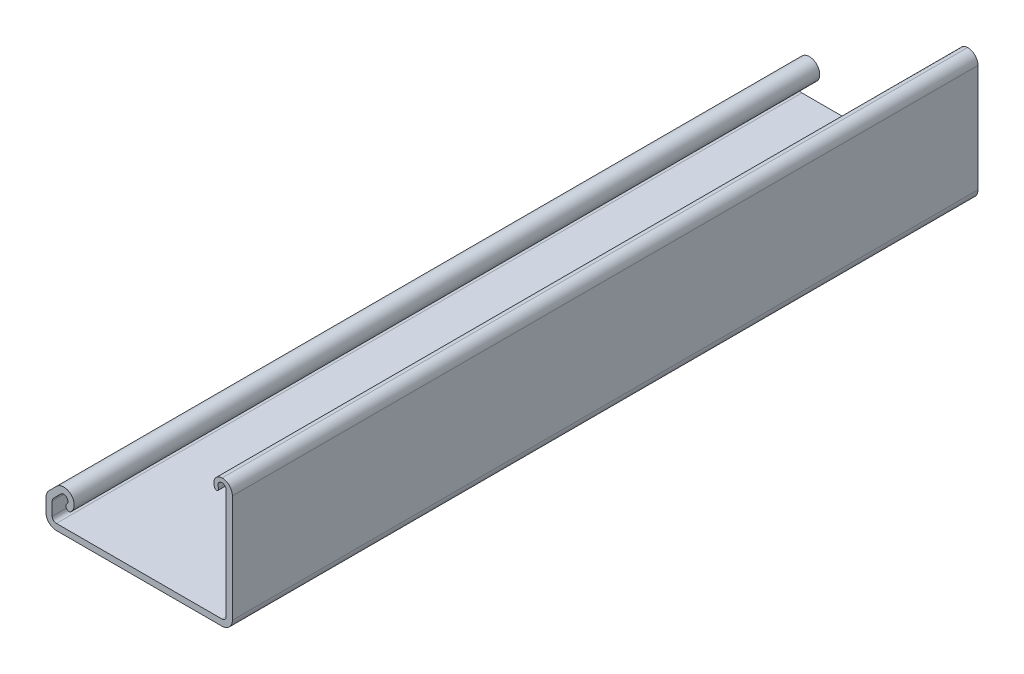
ISO-10303-21;
HEADER;
FILE_DESCRIPTION(('STEP AP214'),'2;1');
FILE_NAME('part.step','',(''),(''),'','','');
FILE_SCHEMA(('AUTOMOTIVE_DESIGN { 1 0 10303 214 1 1 1 1 }'));
ENDSEC;
DATA;
#1=APPLICATION_CONTEXT('core data for automotive mechanical design processes');
#2=APPLICATION_PROTOCOL_DEFINITION('international standard','automotive_design',2000,#1);
#3=PRODUCT_CONTEXT('',#1,'mechanical');
#4=PRODUCT('Part','Part','',(#3));
#5=PRODUCT_RELATED_PRODUCT_CATEGORY('part','',(#4));
#6=PRODUCT_DEFINITION_FORMATION('','',#4);
#7=PRODUCT_DEFINITION_CONTEXT('part definition',#1,'design');
#8=PRODUCT_DEFINITION('design','',#6,#7);
#9=PRODUCT_DEFINITION_SHAPE('','',#8);
#10=(LENGTH_UNIT() NAMED_UNIT(*) SI_UNIT(.MILLI.,.METRE.));
#11=(NAMED_UNIT(*) PLANE_ANGLE_UNIT() SI_UNIT($,.RADIAN.));
#12=(NAMED_UNIT(*) SI_UNIT($,.STERADIAN.) SOLID_ANGLE_UNIT());
#13=UNCERTAINTY_MEASURE_WITH_UNIT(LENGTH_MEASURE(1.E-05),#10,'distance_accuracy_value','');
#14=(GEOMETRIC_REPRESENTATION_CONTEXT(3) GLOBAL_UNCERTAINTY_ASSIGNED_CONTEXT((#13)) GLOBAL_UNIT_ASSIGNED_CONTEXT((#10,
#11,#12)) REPRESENTATION_CONTEXT('',''));
#15=CARTESIAN_POINT('',(0.,0.,0.));
#16=DIRECTION('',(0.,0.,1.));
#17=DIRECTION('',(1.,0.,0.));
#18=AXIS2_PLACEMENT_3D('',#15,#16,#17);
#19=CARTESIAN_POINT('',(-42.5000000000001,5.69962915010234,-90.));
#20=DIRECTION('',(0.,0.,1.));
#21=DIRECTION('',(1.,0.,0.));
#22=AXIS2_PLACEMENT_3D('',#19,#20,#21);
#23=CYLINDRICAL_SURFACE('',#22,2.49999999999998);
#24=DIRECTION('',(0.,0.,1.));
#25=VECTOR('',#24,1.);
#26=CARTESIAN_POINT('',(-45.0000000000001,5.69962915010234,-90.));
#27=LINE('',#26,#25);
#28=CARTESIAN_POINT('',(-45.0000000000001,5.69962915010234,-90.));
#29=VERTEX_POINT('',#28);
#30=CARTESIAN_POINT('',(-45.0000000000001,5.69962915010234,90.));
#31=VERTEX_POINT('',#30);
#32=EDGE_CURVE('E33',#29,#31,#27,.T.);
#33=ORIENTED_EDGE('',*,*,#32,.T.);
#34=CARTESIAN_POINT('',(-42.5000000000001,5.69962915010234,90.));
#35=DIRECTION('',(0.,0.,1.));
#36=DIRECTION('',(1.,0.,0.));
#37=AXIS2_PLACEMENT_3D('',#34,#35,#36);
#38=CIRCLE('',#37,2.49999999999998);
#39=CARTESIAN_POINT('',(-44.2677669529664,7.46739610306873,90.));
#40=VERTEX_POINT('',#39);
#41=EDGE_CURVE('E172',#40,#31,#38,.T.);
#42=ORIENTED_EDGE('',*,*,#41,.F.);
#43=DIRECTION('',(0.,0.,1.));
#44=VECTOR('',#43,1.);
#45=CARTESIAN_POINT('',(-44.2677669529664,7.46739610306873,-90.));
#46=LINE('',#45,#44);
#47=CARTESIAN_POINT('',(-44.2677669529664,7.46739610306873,-90.));
#48=VERTEX_POINT('',#47);
#49=EDGE_CURVE('E11',#48,#40,#46,.T.);
#50=ORIENTED_EDGE('',*,*,#49,.F.);
#51=CARTESIAN_POINT('',(-42.5000000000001,5.69962915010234,-90.));
#52=DIRECTION('',(0.,0.,1.));
#53=DIRECTION('',(1.,0.,0.));
#54=AXIS2_PLACEMENT_3D('',#51,#52,#53);
#55=CIRCLE('',#54,2.49999999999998);
#56=EDGE_CURVE('E173',#48,#29,#55,.T.);
#57=ORIENTED_EDGE('',*,*,#56,.T.);
#58=EDGE_LOOP('',(#33,#42,#50,#57));
#59=FACE_BOUND('',#58,.T.);
#60=ADVANCED_FACE('F30',(#59),#23,.T.);
#61=CARTESIAN_POINT('',(-42.4673961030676,9.26776695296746,-90.));
#62=DIRECTION('',(-0.707106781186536,0.707106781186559,0.));
#63=DIRECTION('',(-0.707106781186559,-0.707106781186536,0.));
#64=AXIS2_PLACEMENT_3D('',#61,#62,#63);
#65=PLANE('',#64);
#66=ORIENTED_EDGE('',*,*,#49,.T.);
#67=DIRECTION('',(-0.707106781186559,-0.707106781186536,0.));
#68=VECTOR('',#67,1.);
#69=CARTESIAN_POINT('',(-42.4673961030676,9.26776695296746,90.));
#70=LINE('',#69,#68);
#71=CARTESIAN_POINT('',(-42.4673961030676,9.26776695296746,90.));
#72=VERTEX_POINT('',#71);
#73=EDGE_CURVE('E190',#72,#40,#70,.T.);
#74=ORIENTED_EDGE('',*,*,#73,.F.);
#75=DIRECTION('',(0.,0.,1.));
#76=VECTOR('',#75,1.);
#77=CARTESIAN_POINT('',(-42.4673961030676,9.26776695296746,-90.));
#78=LINE('',#77,#76);
#79=CARTESIAN_POINT('',(-42.4673961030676,9.26776695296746,-90.));
#80=VERTEX_POINT('',#79);
#81=EDGE_CURVE('E38',#80,#72,#78,.T.);
#82=ORIENTED_EDGE('',*,*,#81,.F.);
#83=DIRECTION('',(-0.707106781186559,-0.707106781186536,0.));
#84=VECTOR('',#83,1.);
#85=CARTESIAN_POINT('',(-42.4673961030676,9.26776695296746,-90.));
#86=LINE('',#85,#84);
#87=EDGE_CURVE('E178',#80,#48,#86,.T.);
#88=ORIENTED_EDGE('',*,*,#87,.T.);
#89=EDGE_LOOP('',(#66,#74,#82,#88));
#90=FACE_BOUND('',#89,.T.);
#91=ADVANCED_FACE('F410',(#90),#65,.T.);
#92=CARTESIAN_POINT('',(-40.6996291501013,7.50000000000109,-90.));
#93=DIRECTION('',(0.,0.,1.));
#94=DIRECTION('',(1.,0.,0.));
#95=AXIS2_PLACEMENT_3D('',#92,#93,#94);
#96=CYLINDRICAL_SURFACE('',#95,2.49999999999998);
#97=ORIENTED_EDGE('',*,*,#81,.T.);
#98=CARTESIAN_POINT('',(-40.6996291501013,7.50000000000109,90.));
#99=DIRECTION('',(0.,0.,1.));
#100=DIRECTION('',(1.,0.,0.));
#101=AXIS2_PLACEMENT_3D('',#98,#99,#100);
#102=CIRCLE('',#101,2.49999999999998);
#103=CARTESIAN_POINT('',(-38.9318621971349,5.73223304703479,90.));
#104=VERTEX_POINT('',#103);
#105=EDGE_CURVE('E242',#104,#72,#102,.T.);
#106=ORIENTED_EDGE('',*,*,#105,.F.);
#107=DIRECTION('',(0.,0.,1.));
#108=VECTOR('',#107,1.);
#109=CARTESIAN_POINT('',(-38.9318621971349,5.73223304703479,-90.));
#110=LINE('',#109,#108);
#111=CARTESIAN_POINT('',(-38.9318621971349,5.73223304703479,-90.));
#112=VERTEX_POINT('',#111);
#113=EDGE_CURVE('E303',#112,#104,#110,.T.);
#114=ORIENTED_EDGE('',*,*,#113,.F.);
#115=CARTESIAN_POINT('',(-40.6996291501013,7.50000000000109,-90.));
#116=DIRECTION('',(0.,0.,1.));
#117=DIRECTION('',(1.,0.,0.));
#118=AXIS2_PLACEMENT_3D('',#115,#116,#117);
#119=CIRCLE('',#118,2.49999999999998);
#120=EDGE_CURVE('E299',#112,#80,#119,.T.);
#121=ORIENTED_EDGE('',*,*,#120,.T.);
#122=EDGE_LOOP('',(#97,#106,#114,#121));
#123=FACE_BOUND('',#122,.T.);
#124=ADVANCED_FACE('F408',(#123),#96,.T.);
#125=CARTESIAN_POINT('',(-39.4621922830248,6.26256313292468,-90.));
#126=DIRECTION('',(0.,0.,1.));
#127=DIRECTION('',(1.,0.,0.));
#128=AXIS2_PLACEMENT_3D('',#125,#126,#127);
#129=CYLINDRICAL_SURFACE('',#128,0.749999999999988);
#130=ORIENTED_EDGE('',*,*,#113,.T.);
#131=CARTESIAN_POINT('',(-39.4621922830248,6.26256313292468,90.));
#132=DIRECTION('',(0.,0.,1.));
#133=DIRECTION('',(1.,0.,0.));
#134=AXIS2_PLACEMENT_3D('',#131,#132,#133);
#135=CIRCLE('',#134,0.749999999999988);
#136=CARTESIAN_POINT('',(-39.9925223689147,6.79289321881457,90.));
#137=VERTEX_POINT('',#136);
#138=EDGE_CURVE('E239',#137,#104,#135,.T.);
#139=ORIENTED_EDGE('',*,*,#138,.F.);
#140=DIRECTION('',(0.,0.,1.));
#141=VECTOR('',#140,1.);
#142=CARTESIAN_POINT('',(-39.9925223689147,6.79289321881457,-90.));
#143=LINE('',#142,#141);
#144=CARTESIAN_POINT('',(-39.9925223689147,6.79289321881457,-90.));
#145=VERTEX_POINT('',#144);
#146=EDGE_CURVE('E305',#145,#137,#143,.T.);
#147=ORIENTED_EDGE('',*,*,#146,.F.);
#148=CARTESIAN_POINT('',(-39.4621922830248,6.26256313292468,-90.));
#149=DIRECTION('',(0.,0.,1.));
#150=DIRECTION('',(1.,0.,0.));
#151=AXIS2_PLACEMENT_3D('',#148,#149,#150);
#152=CIRCLE('',#151,0.749999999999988);
#153=EDGE_CURVE('E296',#145,#112,#152,.T.);
#154=ORIENTED_EDGE('',*,*,#153,.T.);
#155=EDGE_LOOP('',(#130,#139,#147,#154));
#156=FACE_BOUND('',#155,.T.);
#157=ADVANCED_FACE('F406',(#156),#129,.T.);
#158=CARTESIAN_POINT('',(-40.6996291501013,7.50000000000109,-90.));
#159=DIRECTION('',(0.,0.,1.));
#160=DIRECTION('',(1.,0.,0.));
#161=AXIS2_PLACEMENT_3D('',#158,#159,#160);
#162=CYLINDRICAL_SURFACE('',#161,1.00000000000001);
#163=ORIENTED_EDGE('',*,*,#146,.T.);
#164=CARTESIAN_POINT('',(-40.6996291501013,7.50000000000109,90.));
#165=DIRECTION('',(0.,0.,-1.));
#166=DIRECTION('',(1.,0.,0.));
#167=AXIS2_PLACEMENT_3D('',#164,#165,#166);
#168=CIRCLE('',#167,1.00000000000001);
#169=CARTESIAN_POINT('',(-41.4067359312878,8.20710678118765,90.));
#170=VERTEX_POINT('',#169);
#171=EDGE_CURVE('E236',#170,#137,#168,.T.);
#172=ORIENTED_EDGE('',*,*,#171,.F.);
#173=DIRECTION('',(0.,0.,1.));
#174=VECTOR('',#173,1.);
#175=CARTESIAN_POINT('',(-41.4067359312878,8.20710678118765,-90.));
#176=LINE('',#175,#174);
#177=CARTESIAN_POINT('',(-41.4067359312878,8.20710678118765,-90.));
#178=VERTEX_POINT('',#177);
#179=EDGE_CURVE('E307',#178,#170,#176,.T.);
#180=ORIENTED_EDGE('',*,*,#179,.F.);
#181=CARTESIAN_POINT('',(-40.6996291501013,7.50000000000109,-90.));
#182=DIRECTION('',(0.,0.,-1.));
#183=DIRECTION('',(1.,0.,0.));
#184=AXIS2_PLACEMENT_3D('',#181,#182,#183);
#185=CIRCLE('',#184,1.00000000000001);
#186=EDGE_CURVE('E293',#178,#145,#185,.T.);
#187=ORIENTED_EDGE('',*,*,#186,.T.);
#188=EDGE_LOOP('',(#163,#172,#180,#187));
#189=FACE_BOUND('',#188,.T.);
#190=ADVANCED_FACE('F401',(#189),#162,.F.);
#191=CARTESIAN_POINT('',(-43.2071067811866,6.40673593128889,-90.));
#192=DIRECTION('',(0.707106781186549,-0.707106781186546,0.));
#193=DIRECTION('',(0.707106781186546,0.707106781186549,0.));
#194=AXIS2_PLACEMENT_3D('',#191,#192,#193);
#195=PLANE('',#194);
#196=ORIENTED_EDGE('',*,*,#179,.T.);
#197=DIRECTION('',(0.707106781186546,0.707106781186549,0.));
#198=VECTOR('',#197,1.);
#199=CARTESIAN_POINT('',(-43.2071067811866,6.40673593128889,90.));
#200=LINE('',#199,#198);
#201=CARTESIAN_POINT('',(-43.2071067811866,6.40673593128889,90.));
#202=VERTEX_POINT('',#201);
#203=EDGE_CURVE('E233',#202,#170,#200,.T.);
#204=ORIENTED_EDGE('',*,*,#203,.F.);
#205=DIRECTION('',(0.,0.,1.));
#206=VECTOR('',#205,1.);
#207=CARTESIAN_POINT('',(-43.2071067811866,6.40673593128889,-90.));
#208=LINE('',#207,#206);
#209=CARTESIAN_POINT('',(-43.2071067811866,6.40673593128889,-90.));
#210=VERTEX_POINT('',#209);
#211=EDGE_CURVE('E309',#210,#202,#208,.T.);
#212=ORIENTED_EDGE('',*,*,#211,.F.);
#213=DIRECTION('',(0.707106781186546,0.707106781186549,0.));
#214=VECTOR('',#213,1.);
#215=CARTESIAN_POINT('',(-43.2071067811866,6.40673593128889,-90.));
#216=LINE('',#215,#214);
#217=EDGE_CURVE('E290',#210,#178,#216,.T.);
#218=ORIENTED_EDGE('',*,*,#217,.T.);
#219=EDGE_LOOP('',(#196,#204,#212,#218));
#220=FACE_BOUND('',#219,.T.);
#221=ADVANCED_FACE('F396',(#220),#195,.T.);
#222=CARTESIAN_POINT('',(-42.5,5.69962915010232,-90.));
#223=DIRECTION('',(0.,0.,1.));
#224=DIRECTION('',(1.,0.,0.));
#225=AXIS2_PLACEMENT_3D('',#222,#223,#224);
#226=CYLINDRICAL_SURFACE('',#225,1.00000000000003);
#227=ORIENTED_EDGE('',*,*,#211,.T.);
#228=CARTESIAN_POINT('',(-42.5,5.69962915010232,90.));
#229=DIRECTION('',(0.,0.,-1.));
#230=DIRECTION('',(1.,0.,0.));
#231=AXIS2_PLACEMENT_3D('',#228,#229,#230);
#232=CIRCLE('',#231,1.00000000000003);
#233=CARTESIAN_POINT('',(-43.5000000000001,5.69962915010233,90.));
#234=VERTEX_POINT('',#233);
#235=EDGE_CURVE('E230',#234,#202,#232,.T.);
#236=ORIENTED_EDGE('',*,*,#235,.F.);
#237=DIRECTION('',(0.,0.,1.));
#238=VECTOR('',#237,1.);
#239=CARTESIAN_POINT('',(-43.5000000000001,5.69962915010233,-90.));
#240=LINE('',#239,#238);
#241=CARTESIAN_POINT('',(-43.5000000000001,5.69962915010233,-90.));
#242=VERTEX_POINT('',#241);
#243=EDGE_CURVE('E311',#242,#234,#240,.T.);
#244=ORIENTED_EDGE('',*,*,#243,.F.);
#245=CARTESIAN_POINT('',(-42.5,5.69962915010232,-90.));
#246=DIRECTION('',(0.,0.,-1.));
#247=DIRECTION('',(1.,0.,0.));
#248=AXIS2_PLACEMENT_3D('',#245,#246,#247);
#249=CIRCLE('',#248,1.00000000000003);
#250=EDGE_CURVE('E287',#242,#210,#249,.T.);
#251=ORIENTED_EDGE('',*,*,#250,.T.);
#252=EDGE_LOOP('',(#227,#236,#244,#251));
#253=FACE_BOUND('',#252,.T.);
#254=ADVANCED_FACE('F394',(#253),#226,.F.);
#255=CARTESIAN_POINT('',(-43.5000000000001,2.50000000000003,-90.));
#256=DIRECTION('',(1.,0.,0.));
#257=DIRECTION('',(0.,0.,-1.));
#258=AXIS2_PLACEMENT_3D('',#255,#256,#257);
#259=PLANE('',#258);
#260=ORIENTED_EDGE('',*,*,#243,.T.);
#261=DIRECTION('',(0.,1.,0.));
#262=VECTOR('',#261,1.);
#263=CARTESIAN_POINT('',(-43.5000000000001,2.50000000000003,90.));
#264=LINE('',#263,#262);
#265=CARTESIAN_POINT('',(-43.5000000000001,2.50000000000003,90.));
#266=VERTEX_POINT('',#265);
#267=EDGE_CURVE('E227',#266,#234,#264,.T.);
#268=ORIENTED_EDGE('',*,*,#267,.F.);
#269=DIRECTION('',(0.,0.,1.));
#270=VECTOR('',#269,1.);
#271=CARTESIAN_POINT('',(-43.5000000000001,2.50000000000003,-90.));
#272=LINE('',#271,#270);
#273=CARTESIAN_POINT('',(-43.5000000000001,2.50000000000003,-90.));
#274=VERTEX_POINT('',#273);
#275=EDGE_CURVE('E313',#274,#266,#272,.T.);
#276=ORIENTED_EDGE('',*,*,#275,.F.);
#277=DIRECTION('',(0.,1.,0.));
#278=VECTOR('',#277,1.);
#279=CARTESIAN_POINT('',(-43.5000000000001,2.50000000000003,-90.));
#280=LINE('',#279,#278);
#281=EDGE_CURVE('E284',#274,#242,#280,.T.);
#282=ORIENTED_EDGE('',*,*,#281,.T.);
#283=EDGE_LOOP('',(#260,#268,#276,#282));
#284=FACE_BOUND('',#283,.T.);
#285=ADVANCED_FACE('F389',(#284),#259,.T.);
#286=CARTESIAN_POINT('',(-42.5000000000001,2.50000000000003,-90.));
#287=DIRECTION('',(0.,0.,1.));
#288=DIRECTION('',(1.,0.,0.));
#289=AXIS2_PLACEMENT_3D('',#286,#287,#288);
#290=CYLINDRICAL_SURFACE('',#289,1.00000000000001);
#291=ORIENTED_EDGE('',*,*,#275,.T.);
#292=CARTESIAN_POINT('',(-42.5000000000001,2.50000000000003,90.));
#293=DIRECTION('',(0.,0.,-1.));
#294=DIRECTION('',(1.,0.,0.));
#295=AXIS2_PLACEMENT_3D('',#292,#293,#294);
#296=CIRCLE('',#295,1.00000000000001);
#297=CARTESIAN_POINT('',(-42.5000000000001,1.50000000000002,90.));
#298=VERTEX_POINT('',#297);
#299=EDGE_CURVE('E224',#298,#266,#296,.T.);
#300=ORIENTED_EDGE('',*,*,#299,.F.);
#301=DIRECTION('',(0.,0.,1.));
#302=VECTOR('',#301,1.);
#303=CARTESIAN_POINT('',(-42.5000000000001,1.50000000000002,-90.));
#304=LINE('',#303,#302);
#305=CARTESIAN_POINT('',(-42.5000000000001,1.50000000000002,-90.));
#306=VERTEX_POINT('',#305);
#307=EDGE_CURVE('E315',#306,#298,#304,.T.);
#308=ORIENTED_EDGE('',*,*,#307,.F.);
#309=CARTESIAN_POINT('',(-42.5000000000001,2.50000000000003,-90.));
#310=DIRECTION('',(0.,0.,-1.));
#311=DIRECTION('',(1.,0.,0.));
#312=AXIS2_PLACEMENT_3D('',#309,#310,#311);
#313=CIRCLE('',#312,1.00000000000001);
#314=EDGE_CURVE('E281',#306,#274,#313,.T.);
#315=ORIENTED_EDGE('',*,*,#314,.T.);
#316=EDGE_LOOP('',(#291,#300,#308,#315));
#317=FACE_BOUND('',#316,.T.);
#318=ADVANCED_FACE('F384',(#317),#290,.F.);
#319=CARTESIAN_POINT('',(-2.49999999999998,1.49999999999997,-90.));
#320=DIRECTION('',(0.,1.,0.));
#321=DIRECTION('',(-1.,0.,0.));
#322=AXIS2_PLACEMENT_3D('',#319,#320,#321);
#323=PLANE('',#322);
#324=ORIENTED_EDGE('',*,*,#307,.T.);
#325=DIRECTION('',(-1.,0.,0.));
#326=VECTOR('',#325,1.);
#327=CARTESIAN_POINT('',(-2.49999999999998,1.49999999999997,90.));
#328=LINE('',#327,#326);
#329=CARTESIAN_POINT('',(-2.49999999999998,1.49999999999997,90.));
#330=VERTEX_POINT('',#329);
#331=EDGE_CURVE('E221',#330,#298,#328,.T.);
#332=ORIENTED_EDGE('',*,*,#331,.F.);
#333=DIRECTION('',(0.,0.,1.));
#334=VECTOR('',#333,1.);
#335=CARTESIAN_POINT('',(-2.49999999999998,1.49999999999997,-90.));
#336=LINE('',#335,#334);
#337=CARTESIAN_POINT('',(-2.49999999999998,1.49999999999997,-90.));
#338=VERTEX_POINT('',#337);
#339=EDGE_CURVE('E317',#338,#330,#336,.T.);
#340=ORIENTED_EDGE('',*,*,#339,.F.);
#341=DIRECTION('',(-1.,0.,0.));
#342=VECTOR('',#341,1.);
#343=CARTESIAN_POINT('',(-2.49999999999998,1.49999999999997,-90.));
#344=LINE('',#343,#342);
#345=EDGE_CURVE('E278',#338,#306,#344,.T.);
#346=ORIENTED_EDGE('',*,*,#345,.T.);
#347=EDGE_LOOP('',(#324,#332,#340,#346));
#348=FACE_BOUND('',#347,.T.);
#349=ADVANCED_FACE('F382',(#348),#323,.T.);
#350=CARTESIAN_POINT('',(-2.49999999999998,2.49999999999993,-90.));
#351=DIRECTION('',(0.,0.,1.));
#352=DIRECTION('',(1.,0.,0.));
#353=AXIS2_PLACEMENT_3D('',#350,#351,#352);
#354=CYLINDRICAL_SURFACE('',#353,0.999999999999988);
#355=ORIENTED_EDGE('',*,*,#339,.T.);
#356=CARTESIAN_POINT('',(-2.49999999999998,2.49999999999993,90.));
#357=DIRECTION('',(0.,0.,-1.));
#358=DIRECTION('',(1.,0.,0.));
#359=AXIS2_PLACEMENT_3D('',#356,#357,#358);
#360=CIRCLE('',#359,0.999999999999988);
#361=CARTESIAN_POINT('',(-1.49999999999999,2.49999999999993,90.));
#362=VERTEX_POINT('',#361);
#363=EDGE_CURVE('E218',#362,#330,#360,.T.);
#364=ORIENTED_EDGE('',*,*,#363,.F.);
#365=DIRECTION('',(0.,0.,1.));
#366=VECTOR('',#365,1.);
#367=CARTESIAN_POINT('',(-1.49999999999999,2.49999999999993,-90.));
#368=LINE('',#367,#366);
#369=CARTESIAN_POINT('',(-1.49999999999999,2.49999999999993,-90.));
#370=VERTEX_POINT('',#369);
#371=EDGE_CURVE('E319',#370,#362,#368,.T.);
#372=ORIENTED_EDGE('',*,*,#371,.F.);
#373=CARTESIAN_POINT('',(-2.49999999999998,2.49999999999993,-90.));
#374=DIRECTION('',(0.,0.,-1.));
#375=DIRECTION('',(1.,0.,0.));
#376=AXIS2_PLACEMENT_3D('',#373,#374,#375);
#377=CIRCLE('',#376,0.999999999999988);
#378=EDGE_CURVE('E275',#370,#338,#377,.T.);
#379=ORIENTED_EDGE('',*,*,#378,.T.);
#380=EDGE_LOOP('',(#355,#364,#372,#379));
#381=FACE_BOUND('',#380,.T.);
#382=ADVANCED_FACE('F377',(#381),#354,.F.);
#383=CARTESIAN_POINT('',(-1.49999999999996,29.,-90.));
#384=DIRECTION('',(-1.,0.,0.));
#385=DIRECTION('',(0.,-1.,0.));
#386=AXIS2_PLACEMENT_3D('',#383,#384,#385);
#387=PLANE('',#386);
#388=ORIENTED_EDGE('',*,*,#371,.T.);
#389=DIRECTION('',(0.,-1.,0.));
#390=VECTOR('',#389,1.);
#391=CARTESIAN_POINT('',(-1.49999999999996,29.,90.));
#392=LINE('',#391,#390);
#393=CARTESIAN_POINT('',(-1.49999999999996,29.,90.));
#394=VERTEX_POINT('',#393);
#395=EDGE_CURVE('E215',#394,#362,#392,.T.);
#396=ORIENTED_EDGE('',*,*,#395,.F.);
#397=DIRECTION('',(0.,0.,1.));
#398=VECTOR('',#397,1.);
#399=CARTESIAN_POINT('',(-1.49999999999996,29.,-90.));
#400=LINE('',#399,#398);
#401=CARTESIAN_POINT('',(-1.49999999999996,29.,-90.));
#402=VERTEX_POINT('',#401);
#403=EDGE_CURVE('E321',#402,#394,#400,.T.);
#404=ORIENTED_EDGE('',*,*,#403,.F.);
#405=DIRECTION('',(0.,-1.,0.));
#406=VECTOR('',#405,1.);
#407=CARTESIAN_POINT('',(-1.49999999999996,29.,-90.));
#408=LINE('',#407,#406);
#409=EDGE_CURVE('E272',#402,#370,#408,.T.);
#410=ORIENTED_EDGE('',*,*,#409,.T.);
#411=EDGE_LOOP('',(#388,#396,#404,#410));
#412=FACE_BOUND('',#411,.T.);
#413=ADVANCED_FACE('F372',(#412),#387,.T.);
#414=CARTESIAN_POINT('',(-2.49999999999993,29.,-90.));
#415=DIRECTION('',(0.,0.,1.));
#416=DIRECTION('',(1.,0.,0.));
#417=AXIS2_PLACEMENT_3D('',#414,#415,#416);
#418=CYLINDRICAL_SURFACE('',#417,0.999999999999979);
#419=ORIENTED_EDGE('',*,*,#403,.T.);
#420=CARTESIAN_POINT('',(-2.49999999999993,29.,90.));
#421=DIRECTION('',(0.,0.,-1.));
#422=DIRECTION('',(1.,0.,0.));
#423=AXIS2_PLACEMENT_3D('',#420,#421,#422);
#424=CIRCLE('',#423,0.999999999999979);
#425=CARTESIAN_POINT('',(-3.37323048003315,28.5126925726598,90.));
#426=VERTEX_POINT('',#425);
#427=EDGE_CURVE('E212',#426,#394,#424,.T.);
#428=ORIENTED_EDGE('',*,*,#427,.F.);
#429=DIRECTION('',(0.,0.,1.));
#430=VECTOR('',#429,1.);
#431=CARTESIAN_POINT('',(-3.37323048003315,28.5126925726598,-90.));
#432=LINE('',#431,#430);
#433=CARTESIAN_POINT('',(-3.37323048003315,28.5126925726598,-90.));
#434=VERTEX_POINT('',#433);
#435=EDGE_CURVE('E323',#434,#426,#432,.T.);
#436=ORIENTED_EDGE('',*,*,#435,.F.);
#437=CARTESIAN_POINT('',(-2.49999999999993,29.,-90.));
#438=DIRECTION('',(0.,0.,-1.));
#439=DIRECTION('',(1.,0.,0.));
#440=AXIS2_PLACEMENT_3D('',#437,#438,#439);
#441=CIRCLE('',#440,0.999999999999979);
#442=EDGE_CURVE('E269',#434,#402,#441,.T.);
#443=ORIENTED_EDGE('',*,*,#442,.T.);
#444=EDGE_LOOP('',(#419,#428,#436,#443));
#445=FACE_BOUND('',#444,.T.);
#446=ADVANCED_FACE('F370',(#445),#418,.F.);
#447=CARTESIAN_POINT('',(-3.80984572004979,28.2690388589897,-90.));
#448=DIRECTION('',(0.,0.,1.));
#449=DIRECTION('',(1.,0.,0.));
#450=AXIS2_PLACEMENT_3D('',#447,#448,#449);
#451=CYLINDRICAL_SURFACE('',#450,0.500000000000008);
#452=ORIENTED_EDGE('',*,*,#435,.T.);
#453=CARTESIAN_POINT('',(-3.80984572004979,28.2690388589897,90.));
#454=DIRECTION('',(0.,0.,1.));
#455=DIRECTION('',(1.,0.,0.));
#456=AXIS2_PLACEMENT_3D('',#453,#454,#455);
#457=CIRCLE('',#456,0.500000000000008);
#458=CARTESIAN_POINT('',(-4.24646096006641,28.0253851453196,90.));
#459=VERTEX_POINT('',#458);
#460=EDGE_CURVE('E209',#459,#426,#457,.T.);
#461=ORIENTED_EDGE('',*,*,#460,.F.);
#462=DIRECTION('',(0.,0.,1.));
#463=VECTOR('',#462,1.);
#464=CARTESIAN_POINT('',(-4.24646096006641,28.0253851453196,-90.));
#465=LINE('',#464,#463);
#466=CARTESIAN_POINT('',(-4.24646096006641,28.0253851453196,-90.));
#467=VERTEX_POINT('',#466);
#468=EDGE_CURVE('E325',#467,#459,#465,.T.);
#469=ORIENTED_EDGE('',*,*,#468,.F.);
#470=CARTESIAN_POINT('',(-3.80984572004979,28.2690388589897,-90.));
#471=DIRECTION('',(0.,0.,1.));
#472=DIRECTION('',(1.,0.,0.));
#473=AXIS2_PLACEMENT_3D('',#470,#471,#472);
#474=CIRCLE('',#473,0.500000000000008);
#475=EDGE_CURVE('E266',#467,#434,#474,.T.);
#476=ORIENTED_EDGE('',*,*,#475,.T.);
#477=EDGE_LOOP('',(#452,#461,#469,#476));
#478=FACE_BOUND('',#477,.T.);
#479=ADVANCED_FACE('F365',(#478),#451,.T.);
#480=CARTESIAN_POINT('',(-2.49999999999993,29.,-90.));
#481=DIRECTION('',(0.,0.,1.));
#482=DIRECTION('',(1.,0.,0.));
#483=AXIS2_PLACEMENT_3D('',#480,#481,#482);
#484=CYLINDRICAL_SURFACE('',#483,1.99999999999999);
#485=ORIENTED_EDGE('',*,*,#468,.T.);
#486=CARTESIAN_POINT('',(-2.49999999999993,29.,90.));
#487=DIRECTION('',(0.,0.,1.));
#488=DIRECTION('',(1.,0.,0.));
#489=AXIS2_PLACEMENT_3D('',#486,#487,#488);
#490=CIRCLE('',#489,1.99999999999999);
#491=CARTESIAN_POINT('',(-2.49999999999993,30.9999999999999,90.));
#492=VERTEX_POINT('',#491);
#493=EDGE_CURVE('E206',#492,#459,#490,.T.);
#494=ORIENTED_EDGE('',*,*,#493,.F.);
#495=DIRECTION('',(0.,0.,1.));
#496=VECTOR('',#495,1.);
#497=CARTESIAN_POINT('',(-2.49999999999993,30.9999999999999,-90.));
#498=LINE('',#497,#496);
#499=CARTESIAN_POINT('',(-2.49999999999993,30.9999999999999,-90.));
#500=VERTEX_POINT('',#499);
#501=EDGE_CURVE('E327',#500,#492,#498,.T.);
#502=ORIENTED_EDGE('',*,*,#501,.F.);
#503=CARTESIAN_POINT('',(-2.49999999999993,29.,-90.));
#504=DIRECTION('',(0.,0.,1.));
#505=DIRECTION('',(1.,0.,0.));
#506=AXIS2_PLACEMENT_3D('',#503,#504,#505);
#507=CIRCLE('',#506,1.99999999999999);
#508=EDGE_CURVE('E263',#500,#467,#507,.T.);
#509=ORIENTED_EDGE('',*,*,#508,.T.);
#510=EDGE_LOOP('',(#485,#494,#502,#509));
#511=FACE_BOUND('',#510,.T.);
#512=ADVANCED_FACE('F360',(#511),#484,.T.);
#513=CARTESIAN_POINT('',(-2.49999999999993,28.4999999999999,-90.));
#514=DIRECTION('',(0.,0.,1.));
#515=DIRECTION('',(1.,0.,0.));
#516=AXIS2_PLACEMENT_3D('',#513,#514,#515);
#517=CYLINDRICAL_SURFACE('',#516,2.49999999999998);
#518=ORIENTED_EDGE('',*,*,#501,.T.);
#519=CARTESIAN_POINT('',(-2.49999999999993,28.4999999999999,90.));
#520=DIRECTION('',(0.,0.,1.));
#521=DIRECTION('',(1.,0.,0.));
#522=AXIS2_PLACEMENT_3D('',#519,#520,#521);
#523=CIRCLE('',#522,2.49999999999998);
#524=CARTESIAN_POINT('',(0.,28.4999999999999,90.));
#525=VERTEX_POINT('',#524);
#526=EDGE_CURVE('E203',#525,#492,#523,.T.);
#527=ORIENTED_EDGE('',*,*,#526,.F.);
#528=DIRECTION('',(0.,0.,1.));
#529=VECTOR('',#528,1.);
#530=CARTESIAN_POINT('',(0.,28.4999999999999,-90.));
#531=LINE('',#530,#529);
#532=CARTESIAN_POINT('',(0.,28.4999999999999,-90.));
#533=VERTEX_POINT('',#532);
#534=EDGE_CURVE('E329',#533,#525,#531,.T.);
#535=ORIENTED_EDGE('',*,*,#534,.F.);
#536=CARTESIAN_POINT('',(-2.49999999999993,28.4999999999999,-90.));
#537=DIRECTION('',(0.,0.,1.));
#538=DIRECTION('',(1.,0.,0.));
#539=AXIS2_PLACEMENT_3D('',#536,#537,#538);
#540=CIRCLE('',#539,2.49999999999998);
#541=EDGE_CURVE('E260',#533,#500,#540,.T.);
#542=ORIENTED_EDGE('',*,*,#541,.T.);
#543=EDGE_LOOP('',(#518,#527,#535,#542));
#544=FACE_BOUND('',#543,.T.);
#545=ADVANCED_FACE('F358',(#544),#517,.T.);
#546=CARTESIAN_POINT('',(0.,2.50000000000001,-90.));
#547=DIRECTION('',(1.,0.,0.));
#548=DIRECTION('',(0.,1.,0.));
#549=AXIS2_PLACEMENT_3D('',#546,#547,#548);
#550=PLANE('',#549);
#551=ORIENTED_EDGE('',*,*,#534,.T.);
#552=DIRECTION('',(0.,1.,0.));
#553=VECTOR('',#552,1.);
#554=CARTESIAN_POINT('',(0.,2.50000000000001,90.));
#555=LINE('',#554,#553);
#556=CARTESIAN_POINT('',(0.,2.50000000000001,90.));
#557=VERTEX_POINT('',#556);
#558=EDGE_CURVE('E200',#557,#525,#555,.T.);
#559=ORIENTED_EDGE('',*,*,#558,.F.);
#560=DIRECTION('',(0.,0.,1.));
#561=VECTOR('',#560,1.);
#562=CARTESIAN_POINT('',(0.,2.50000000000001,-90.));
#563=LINE('',#562,#561);
#564=CARTESIAN_POINT('',(0.,2.50000000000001,-90.));
#565=VERTEX_POINT('',#564);
#566=EDGE_CURVE('E331',#565,#557,#563,.T.);
#567=ORIENTED_EDGE('',*,*,#566,.F.);
#568=DIRECTION('',(0.,1.,0.));
#569=VECTOR('',#568,1.);
#570=CARTESIAN_POINT('',(0.,2.50000000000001,-90.));
#571=LINE('',#570,#569);
#572=EDGE_CURVE('E257',#565,#533,#571,.T.);
#573=ORIENTED_EDGE('',*,*,#572,.T.);
#574=EDGE_LOOP('',(#551,#559,#567,#573));
#575=FACE_BOUND('',#574,.T.);
#576=ADVANCED_FACE('F353',(#575),#550,.T.);
#577=CARTESIAN_POINT('',(-2.49999999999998,2.50000000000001,-90.));
#578=DIRECTION('',(0.,0.,1.));
#579=DIRECTION('',(1.,0.,0.));
#580=AXIS2_PLACEMENT_3D('',#577,#578,#579);
#581=CYLINDRICAL_SURFACE('',#580,2.5);
#582=ORIENTED_EDGE('',*,*,#566,.T.);
#583=CARTESIAN_POINT('',(-2.49999999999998,2.50000000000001,90.));
#584=DIRECTION('',(0.,0.,1.));
#585=DIRECTION('',(1.,0.,0.));
#586=AXIS2_PLACEMENT_3D('',#583,#584,#585);
#587=CIRCLE('',#586,2.5);
#588=CARTESIAN_POINT('',(-2.49999999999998,0.,90.));
#589=VERTEX_POINT('',#588);
#590=EDGE_CURVE('E197',#589,#557,#587,.T.);
#591=ORIENTED_EDGE('',*,*,#590,.F.);
#592=DIRECTION('',(0.,0.,1.));
#593=VECTOR('',#592,1.);
#594=CARTESIAN_POINT('',(-2.49999999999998,0.,-90.));
#595=LINE('',#594,#593);
#596=CARTESIAN_POINT('',(-2.49999999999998,0.,-90.));
#597=VERTEX_POINT('',#596);
#598=EDGE_CURVE('E333',#597,#589,#595,.T.);
#599=ORIENTED_EDGE('',*,*,#598,.F.);
#600=CARTESIAN_POINT('',(-2.49999999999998,2.50000000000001,-90.));
#601=DIRECTION('',(0.,0.,1.));
#602=DIRECTION('',(1.,0.,0.));
#603=AXIS2_PLACEMENT_3D('',#600,#601,#602);
#604=CIRCLE('',#603,2.5);
#605=EDGE_CURVE('E254',#597,#565,#604,.T.);
#606=ORIENTED_EDGE('',*,*,#605,.T.);
#607=EDGE_LOOP('',(#582,#591,#599,#606));
#608=FACE_BOUND('',#607,.T.);
#609=ADVANCED_FACE('F346',(#608),#581,.T.);
#610=CARTESIAN_POINT('',(-42.5000000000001,0.,-90.));
#611=DIRECTION('',(0.,-1.,0.));
#612=DIRECTION('',(1.,0.,0.));
#613=AXIS2_PLACEMENT_3D('',#610,#611,#612);
#614=PLANE('',#613);
#615=ORIENTED_EDGE('',*,*,#598,.T.);
#616=DIRECTION('',(1.,0.,0.));
#617=VECTOR('',#616,1.);
#618=CARTESIAN_POINT('',(-42.5000000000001,0.,90.));
#619=LINE('',#618,#617);
#620=CARTESIAN_POINT('',(-42.5000000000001,0.,90.));
#621=VERTEX_POINT('',#620);
#622=EDGE_CURVE('E194',#621,#589,#619,.T.);
#623=ORIENTED_EDGE('',*,*,#622,.F.);
#624=DIRECTION('',(0.,0.,1.));
#625=VECTOR('',#624,1.);
#626=CARTESIAN_POINT('',(-42.5000000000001,0.,-90.));
#627=LINE('',#626,#625);
#628=CARTESIAN_POINT('',(-42.5000000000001,0.,-90.));
#629=VERTEX_POINT('',#628);
#630=EDGE_CURVE('E335',#629,#621,#627,.T.);
#631=ORIENTED_EDGE('',*,*,#630,.F.);
#632=DIRECTION('',(1.,0.,0.));
#633=VECTOR('',#632,1.);
#634=CARTESIAN_POINT('',(-42.5000000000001,0.,-90.));
#635=LINE('',#634,#633);
#636=EDGE_CURVE('E251',#629,#597,#635,.T.);
#637=ORIENTED_EDGE('',*,*,#636,.T.);
#638=EDGE_LOOP('',(#615,#623,#631,#637));
#639=FACE_BOUND('',#638,.T.);
#640=ADVANCED_FACE('F343',(#639),#614,.T.);
#641=CARTESIAN_POINT('',(-42.5000000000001,2.50000000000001,-90.));
#642=DIRECTION('',(0.,0.,1.));
#643=DIRECTION('',(1.,0.,0.));
#644=AXIS2_PLACEMENT_3D('',#641,#642,#643);
#645=CYLINDRICAL_SURFACE('',#644,2.50000000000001);
#646=ORIENTED_EDGE('',*,*,#630,.T.);
#647=CARTESIAN_POINT('',(-42.5000000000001,2.50000000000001,90.));
#648=DIRECTION('',(0.,0.,1.));
#649=DIRECTION('',(1.,0.,0.));
#650=AXIS2_PLACEMENT_3D('',#647,#648,#649);
#651=CIRCLE('',#650,2.50000000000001);
#652=CARTESIAN_POINT('',(-45.0000000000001,2.50000000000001,90.));
#653=VERTEX_POINT('',#652);
#654=EDGE_CURVE('E185',#653,#621,#651,.T.);
#655=ORIENTED_EDGE('',*,*,#654,.F.);
#656=DIRECTION('',(0.,0.,1.));
#657=VECTOR('',#656,1.);
#658=CARTESIAN_POINT('',(-45.0000000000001,2.50000000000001,-90.));
#659=LINE('',#658,#657);
#660=CARTESIAN_POINT('',(-45.0000000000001,2.50000000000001,-90.));
#661=VERTEX_POINT('',#660);
#662=EDGE_CURVE('E177',#661,#653,#659,.T.);
#663=ORIENTED_EDGE('',*,*,#662,.F.);
#664=CARTESIAN_POINT('',(-42.5000000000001,2.50000000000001,-90.));
#665=DIRECTION('',(0.,0.,1.));
#666=DIRECTION('',(1.,0.,0.));
#667=AXIS2_PLACEMENT_3D('',#664,#665,#666);
#668=CIRCLE('',#667,2.50000000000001);
#669=EDGE_CURVE('E248',#661,#629,#668,.T.);
#670=ORIENTED_EDGE('',*,*,#669,.T.);
#671=EDGE_LOOP('',(#646,#655,#663,#670));
#672=FACE_BOUND('',#671,.T.);
#673=ADVANCED_FACE('F337',(#672),#645,.T.);
#674=CARTESIAN_POINT('',(-45.0000000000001,5.69962915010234,-90.));
#675=DIRECTION('',(-1.,0.,0.));
#676=DIRECTION('',(0.,-1.,0.));
#677=AXIS2_PLACEMENT_3D('',#674,#675,#676);
#678=PLANE('',#677);
#679=ORIENTED_EDGE('',*,*,#662,.T.);
#680=DIRECTION('',(0.,-1.,0.));
#681=VECTOR('',#680,1.);
#682=CARTESIAN_POINT('',(-45.0000000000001,5.69962915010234,90.));
#683=LINE('',#682,#681);
#684=EDGE_CURVE('E180',#31,#653,#683,.T.);
#685=ORIENTED_EDGE('',*,*,#684,.F.);
#686=ORIENTED_EDGE('',*,*,#32,.F.);
#687=DIRECTION('',(0.,-1.,0.));
#688=VECTOR('',#687,1.);
#689=CARTESIAN_POINT('',(-45.0000000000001,5.69962915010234,-90.));
#690=LINE('',#689,#688);
#691=EDGE_CURVE('E246',#29,#661,#690,.T.);
#692=ORIENTED_EDGE('',*,*,#691,.T.);
#693=EDGE_LOOP('',(#679,#685,#686,#692));
#694=FACE_BOUND('',#693,.T.);
#695=ADVANCED_FACE('F181',(#694),#678,.T.);
#696=CARTESIAN_POINT('',(-42.5000000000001,5.69962915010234,-90.));
#697=DIRECTION('',(0.,0.,1.));
#698=DIRECTION('',(1.,0.,0.));
#699=AXIS2_PLACEMENT_3D('',#696,#697,#698);
#700=PLANE('',#699);
#701=ORIENTED_EDGE('',*,*,#56,.F.);
#702=ORIENTED_EDGE('',*,*,#87,.F.);
#703=ORIENTED_EDGE('',*,*,#120,.F.);
#704=ORIENTED_EDGE('',*,*,#153,.F.);
#705=ORIENTED_EDGE('',*,*,#186,.F.);
#706=ORIENTED_EDGE('',*,*,#217,.F.);
#707=ORIENTED_EDGE('',*,*,#250,.F.);
#708=ORIENTED_EDGE('',*,*,#281,.F.);
#709=ORIENTED_EDGE('',*,*,#314,.F.);
#710=ORIENTED_EDGE('',*,*,#345,.F.);
#711=ORIENTED_EDGE('',*,*,#378,.F.);
#712=ORIENTED_EDGE('',*,*,#409,.F.);
#713=ORIENTED_EDGE('',*,*,#442,.F.);
#714=ORIENTED_EDGE('',*,*,#475,.F.);
#715=ORIENTED_EDGE('',*,*,#508,.F.);
#716=ORIENTED_EDGE('',*,*,#541,.F.);
#717=ORIENTED_EDGE('',*,*,#572,.F.);
#718=ORIENTED_EDGE('',*,*,#605,.F.);
#719=ORIENTED_EDGE('',*,*,#636,.F.);
#720=ORIENTED_EDGE('',*,*,#669,.F.);
#721=ORIENTED_EDGE('',*,*,#691,.F.);
#722=EDGE_LOOP('',(#701,#702,#703,#704,#705,#706,#707,#708,#709,#710,#711,#712,#713,#714,#715,
#716,#717,#718,#719,#720,#721));
#723=FACE_BOUND('',#722,.T.);
#724=ADVANCED_FACE('F349',(#723),#700,.F.);
#725=CARTESIAN_POINT('',(-42.5000000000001,5.69962915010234,90.));
#726=DIRECTION('',(0.,0.,1.));
#727=DIRECTION('',(1.,0.,0.));
#728=AXIS2_PLACEMENT_3D('',#725,#726,#727);
#729=PLANE('',#728);
#730=ORIENTED_EDGE('',*,*,#41,.T.);
#731=ORIENTED_EDGE('',*,*,#684,.T.);
#732=ORIENTED_EDGE('',*,*,#654,.T.);
#733=ORIENTED_EDGE('',*,*,#622,.T.);
#734=ORIENTED_EDGE('',*,*,#590,.T.);
#735=ORIENTED_EDGE('',*,*,#558,.T.);
#736=ORIENTED_EDGE('',*,*,#526,.T.);
#737=ORIENTED_EDGE('',*,*,#493,.T.);
#738=ORIENTED_EDGE('',*,*,#460,.T.);
#739=ORIENTED_EDGE('',*,*,#427,.T.);
#740=ORIENTED_EDGE('',*,*,#395,.T.);
#741=ORIENTED_EDGE('',*,*,#363,.T.);
#742=ORIENTED_EDGE('',*,*,#331,.T.);
#743=ORIENTED_EDGE('',*,*,#299,.T.);
#744=ORIENTED_EDGE('',*,*,#267,.T.);
#745=ORIENTED_EDGE('',*,*,#235,.T.);
#746=ORIENTED_EDGE('',*,*,#203,.T.);
#747=ORIENTED_EDGE('',*,*,#171,.T.);
#748=ORIENTED_EDGE('',*,*,#138,.T.);
#749=ORIENTED_EDGE('',*,*,#105,.T.);
#750=ORIENTED_EDGE('',*,*,#73,.T.);
#751=EDGE_LOOP('',(#730,#731,#732,#733,#734,#735,#736,#737,#738,#739,#740,#741,#742,#743,#744,
#745,#746,#747,#748,#749,#750));
#752=FACE_BOUND('',#751,.T.);
#753=ADVANCED_FACE('F188',(#752),#729,.T.);
#754=CLOSED_SHELL('',(#60,#91,#124,#157,#190,#221,#254,#285,#318,#349,#382,#413,#446,#479,#512,
#545,#576,#609,#640,#673,#695,#724,#753));
#755=MANIFOLD_SOLID_BREP('B2',#754);
#756=ADVANCED_BREP_SHAPE_REPRESENTATION('',(#18,#755),#14);
#757=SHAPE_DEFINITION_REPRESENTATION(#9,#756);
ENDSEC;
END-ISO-10303-21;
